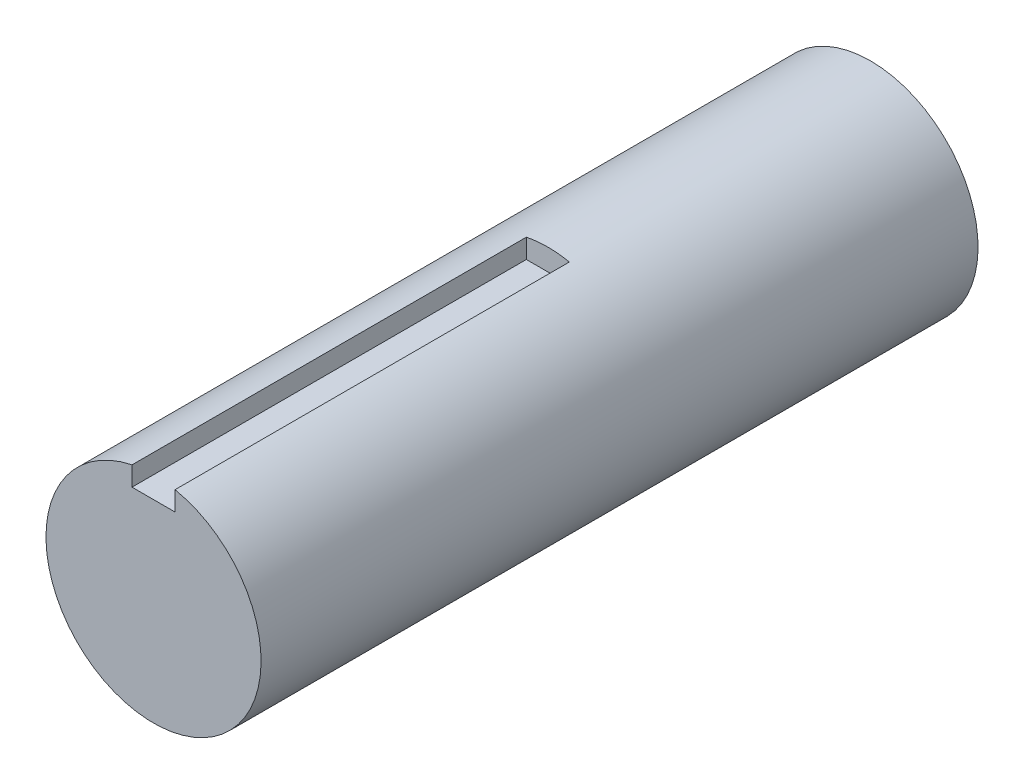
from build123d import *

# Parameters (mm, degrees)
SKETCH1_W          = 100
SKETCH1_H          = 15
SKETCH2_W          = 6
SKETCH2_H          = 6
CUT_EXTRUDE1_DEPTH = 55


with BuildPart() as part:
    # Sketch1 → Revolve1 (revolve)
    with BuildSketch(Plane(origin=(0, 0, 0), x_dir=(0, 0, -1), z_dir=(1, 0, 0))):
        with Locations((-50, 7.5)):
            Rectangle(SKETCH1_W, SKETCH1_H)
    revolve(axis=Axis((0, 0, 0), (0, 0, 1)))

    # Sketch2 → Cut-Extrude1 (cut)
    with BuildSketch(Plane.XY.offset(100)):
        with Locations((0, 15)):
            Rectangle(SKETCH2_W, SKETCH2_H)
    extrude(amount=-CUT_EXTRUDE1_DEPTH, mode=Mode.SUBTRACT)


solid = part.part
